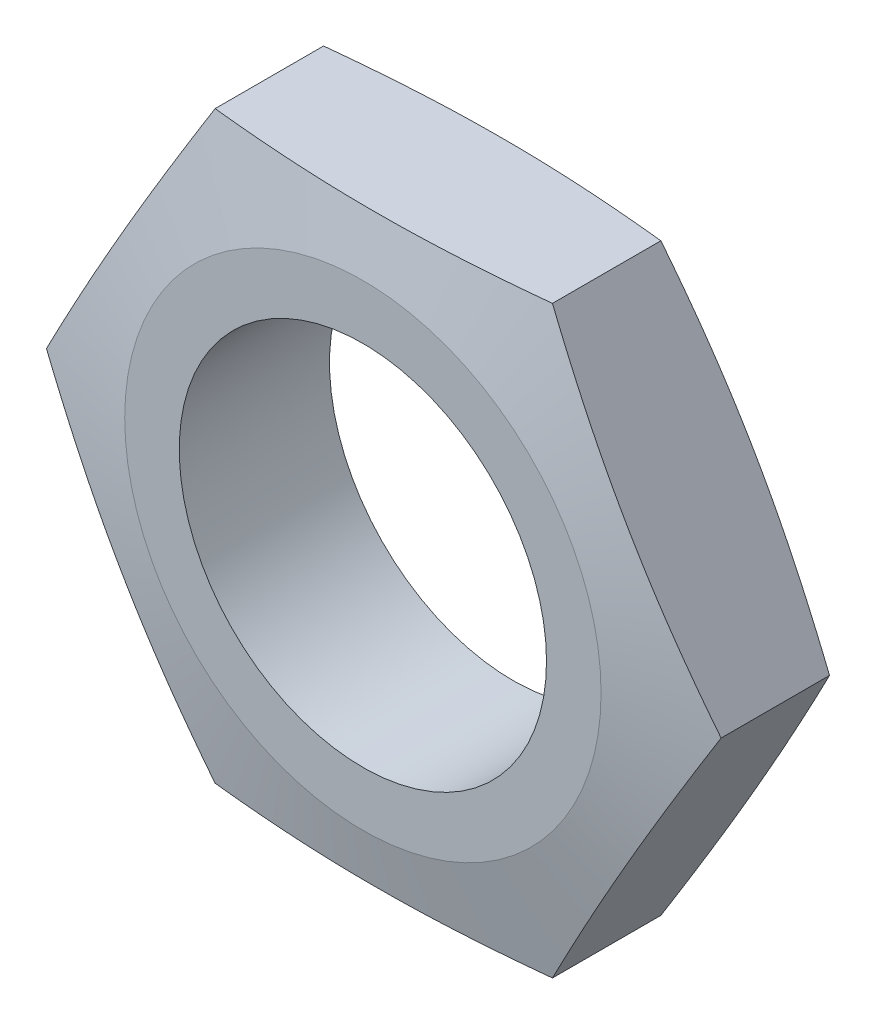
ISO-10303-21;
HEADER;
FILE_DESCRIPTION(('STEP AP214'),'2;1');
FILE_NAME('part.step','',(''),(''),'','','');
FILE_SCHEMA(('AUTOMOTIVE_DESIGN { 1 0 10303 214 1 1 1 1 }'));
ENDSEC;
DATA;
#1=APPLICATION_CONTEXT('core data for automotive mechanical design processes');
#2=APPLICATION_PROTOCOL_DEFINITION('international standard','automotive_design',2000,#1);
#3=PRODUCT_CONTEXT('',#1,'mechanical');
#4=PRODUCT('Part','Part','',(#3));
#5=PRODUCT_RELATED_PRODUCT_CATEGORY('part','',(#4));
#6=PRODUCT_DEFINITION_FORMATION('','',#4);
#7=PRODUCT_DEFINITION_CONTEXT('part definition',#1,'design');
#8=PRODUCT_DEFINITION('design','',#6,#7);
#9=PRODUCT_DEFINITION_SHAPE('','',#8);
#10=(LENGTH_UNIT() NAMED_UNIT(*) SI_UNIT(.MILLI.,.METRE.));
#11=(NAMED_UNIT(*) PLANE_ANGLE_UNIT() SI_UNIT($,.RADIAN.));
#12=(NAMED_UNIT(*) SI_UNIT($,.STERADIAN.) SOLID_ANGLE_UNIT());
#13=UNCERTAINTY_MEASURE_WITH_UNIT(LENGTH_MEASURE(1.E-05),#10,'distance_accuracy_value','');
#14=(GEOMETRIC_REPRESENTATION_CONTEXT(3) GLOBAL_UNCERTAINTY_ASSIGNED_CONTEXT((#13)) GLOBAL_UNIT_ASSIGNED_CONTEXT((#10,
#11,#12)) REPRESENTATION_CONTEXT('',''));
#15=CARTESIAN_POINT('',(0.,0.,0.));
#16=DIRECTION('',(0.,0.,1.));
#17=DIRECTION('',(1.,0.,0.));
#18=AXIS2_PLACEMENT_3D('',#15,#16,#17);
#19=CARTESIAN_POINT('',(-5.13264389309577,-8.89,2.286));
#20=DIRECTION('',(0.,1.,0.));
#21=DIRECTION('',(-1.,0.,0.));
#22=AXIS2_PLACEMENT_3D('',#19,#20,#21);
#23=PLANE('',#22);
#24=CARTESIAN_POINT('',(-13.5389504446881,-8.89,0.398716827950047));
#25=CARTESIAN_POINT('',(-13.13577838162,-8.89,0.469772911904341));
#26=CARTESIAN_POINT('',(-12.7324462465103,-8.89,0.539936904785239));
#27=CARTESIAN_POINT('',(-11.9253845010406,-8.89,0.678005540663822));
#28=CARTESIAN_POINT('',(-11.5216548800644,-8.89,0.74591012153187));
#29=CARTESIAN_POINT('',(-10.7134952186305,-8.89,0.879021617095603));
#30=CARTESIAN_POINT('',(-10.309064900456,-8.89,0.944226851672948));
#31=CARTESIAN_POINT('',(-9.49967433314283,-8.89,1.07125883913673));
#32=CARTESIAN_POINT('',(-9.09471408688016,-8.89,1.13308561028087));
#33=CARTESIAN_POINT('',(-8.2861498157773,-8.89,1.25228035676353));
#34=CARTESIAN_POINT('',(-7.8825487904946,-8.89,1.30966858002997));
#35=CARTESIAN_POINT('',(-7.07465636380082,-8.89,1.4193512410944));
#36=CARTESIAN_POINT('',(-6.67036497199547,-8.89,1.47164574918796));
#37=CARTESIAN_POINT('',(-5.86104887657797,-8.89,1.56997388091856));
#38=CARTESIAN_POINT('',(-5.45602423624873,-8.89,1.6160080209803));
#39=CARTESIAN_POINT('',(-4.64517476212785,-8.89,1.70047798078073));
#40=CARTESIAN_POINT('',(-4.23934992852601,-8.89,1.73891380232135));
#41=CARTESIAN_POINT('',(-3.42416088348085,-8.89,1.80698098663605));
#42=CARTESIAN_POINT('',(-3.01479142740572,-8.89,1.83655043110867));
#43=CARTESIAN_POINT('',(-2.19542155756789,-8.89,1.88514118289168));
#44=CARTESIAN_POINT('',(-1.78542115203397,-8.89,1.90416262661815));
#45=CARTESIAN_POINT('',(-0.965148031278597,-8.89,1.9306064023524));
#46=CARTESIAN_POINT('',(-0.554875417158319,-8.89,1.93803181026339));
#47=CARTESIAN_POINT('',(0.265711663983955,-8.89,1.94084566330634));
#48=CARTESIAN_POINT('',(0.676026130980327,-8.89,1.93623411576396));
#49=CARTESIAN_POINT('',(1.49727621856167,-8.89,1.91523087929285));
#50=CARTESIAN_POINT('',(1.90821114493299,-8.89,1.89881256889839));
#51=CARTESIAN_POINT('',(2.72949672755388,-8.89,1.85509983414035));
#52=CARTESIAN_POINT('',(3.13984737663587,-8.89,1.82780527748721));
#53=CARTESIAN_POINT('',(3.95994678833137,-8.89,1.76367016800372));
#54=CARTESIAN_POINT('',(4.36969526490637,-8.89,1.72682601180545));
#55=CARTESIAN_POINT('',(5.18837857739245,-8.89,1.64507569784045));
#56=CARTESIAN_POINT('',(5.59731341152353,-8.89,1.60016952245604));
#57=CARTESIAN_POINT('',(6.39205589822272,-8.89,1.50634278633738));
#58=CARTESIAN_POINT('',(6.77790571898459,-8.89,1.45777589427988));
#59=CARTESIAN_POINT('',(7.54896076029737,-8.89,1.35574653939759));
#60=CARTESIAN_POINT('',(7.93416596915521,-8.89,1.3022839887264));
#61=CARTESIAN_POINT('',(8.70401923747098,-8.89,1.19134899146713));
#62=CARTESIAN_POINT('',(9.0886672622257,-8.89,1.13387630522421));
#63=CARTESIAN_POINT('',(9.85745933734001,-8.89,1.0156457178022));
#64=CARTESIAN_POINT('',(10.2416033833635,-8.89,0.954887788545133));
#65=CARTESIAN_POINT('',(11.3935270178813,-8.89,0.768578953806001));
#66=CARTESIAN_POINT('',(12.1606566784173,-8.88999999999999,0.639013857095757));
#67=CARTESIAN_POINT('',(13.6936094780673,-8.88999999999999,0.372617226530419));
#68=CARTESIAN_POINT('',(14.4594326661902,-8.88999999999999,0.235785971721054));
#69=CARTESIAN_POINT('',(15.9854281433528,-8.88999999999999,-0.0421323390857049));
#70=CARTESIAN_POINT('',(16.7456061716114,-8.88999999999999,-0.183187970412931));
#71=CARTESIAN_POINT('',(18.2652832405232,-8.88999999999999,-0.468948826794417));
#72=CARTESIAN_POINT('',(19.024782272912,-8.88999999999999,-0.613654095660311));
#73=CARTESIAN_POINT('',(20.5426135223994,-8.88999999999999,-0.905631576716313));
#74=CARTESIAN_POINT('',(21.3009461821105,-8.88999999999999,-1.05290149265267));
#75=CARTESIAN_POINT('',(22.8171895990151,-8.88999999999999,-1.34951165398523));
#76=CARTESIAN_POINT('',(23.5751003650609,-8.88999999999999,-1.49885185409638));
#77=CARTESIAN_POINT('',(24.3328647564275,-8.88999999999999,-1.64892209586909));
#78=B_SPLINE_CURVE_WITH_KNOTS('',3,(#24,#25,#26,#27,#28,#29,#30,#31,#32,#33,#34,#35,#36,#37,#38,
#39,#40,#41,#42,#43,#44,#45,#46,#47,#48,#49,#50,#51,#52,#53,#54,#55,#56,#57,#58,#59,#60,#61,#62,
#63,#64,#65,#66,#67,#68,#69,#70,#71,#72,#73,#74,#75,#76,#77),.UNSPECIFIED.,.F.,.F.,(4,2,2,2,2,2,
2,2,2,2,2,2,2,2,2,2,2,2,2,2,2,2,2,2,2,2,4),(0.,1.22816040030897,2.45635454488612,
3.68530198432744,4.91424278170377,6.13719865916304,7.36013765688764,8.58297571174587,
9.80581347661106,11.0370020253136,12.2681746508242,13.4990206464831,14.7298658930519,
15.9634951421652,17.1971393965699,18.431249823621,19.6653629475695,20.8320090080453,
21.9986760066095,23.1654127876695,24.332159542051,26.6660818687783,28.9999146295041,
31.3193643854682,33.6388419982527,35.9563399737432,38.2737873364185),.UNSPECIFIED.);
#79=CARTESIAN_POINT('',(-5.13264389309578,-8.89,1.64964364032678));
#80=VERTEX_POINT('',#79);
#81=CARTESIAN_POINT('',(5.13264389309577,-8.89,1.64964364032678));
#82=VERTEX_POINT('',#81);
#83=EDGE_CURVE('E208',#80,#82,#78,.T.);
#84=ORIENTED_EDGE('',*,*,#83,.F.);
#85=DIRECTION('',(0.,0.,-1.));
#86=VECTOR('',#85,1.);
#87=CARTESIAN_POINT('',(-5.13264389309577,-8.89,2.286));
#88=LINE('',#87,#86);
#89=CARTESIAN_POINT('',(-5.13264389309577,-8.89,-1.64964364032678));
#90=VERTEX_POINT('',#89);
#91=EDGE_CURVE('E64',#80,#90,#88,.T.);
#92=ORIENTED_EDGE('',*,*,#91,.T.);
#93=CARTESIAN_POINT('',(-13.5389504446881,-8.89,-0.398716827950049));
#94=CARTESIAN_POINT('',(-13.13577838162,-8.89,-0.469772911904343));
#95=CARTESIAN_POINT('',(-12.7324462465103,-8.89,-0.539936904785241));
#96=CARTESIAN_POINT('',(-11.9253845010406,-8.89,-0.678005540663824));
#97=CARTESIAN_POINT('',(-11.5216548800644,-8.89,-0.745910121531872));
#98=CARTESIAN_POINT('',(-10.7134952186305,-8.89,-0.879021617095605));
#99=CARTESIAN_POINT('',(-10.309064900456,-8.89,-0.94422685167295));
#100=CARTESIAN_POINT('',(-9.49967433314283,-8.89,-1.07125883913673));
#101=CARTESIAN_POINT('',(-9.09471408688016,-8.89,-1.13308561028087));
#102=CARTESIAN_POINT('',(-8.2861498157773,-8.89,-1.25228035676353));
#103=CARTESIAN_POINT('',(-7.8825487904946,-8.89,-1.30966858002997));
#104=CARTESIAN_POINT('',(-7.07465636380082,-8.89,-1.4193512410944));
#105=CARTESIAN_POINT('',(-6.67036497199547,-8.89,-1.47164574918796));
#106=CARTESIAN_POINT('',(-5.86104887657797,-8.89,-1.56997388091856));
#107=CARTESIAN_POINT('',(-5.45602423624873,-8.89,-1.6160080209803));
#108=CARTESIAN_POINT('',(-4.64517476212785,-8.89,-1.70047798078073));
#109=CARTESIAN_POINT('',(-4.23934992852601,-8.89,-1.73891380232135));
#110=CARTESIAN_POINT('',(-3.42416088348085,-8.89,-1.80698098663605));
#111=CARTESIAN_POINT('',(-3.01479142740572,-8.89,-1.83655043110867));
#112=CARTESIAN_POINT('',(-2.19542155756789,-8.89,-1.88514118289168));
#113=CARTESIAN_POINT('',(-1.78542115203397,-8.89,-1.90416262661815));
#114=CARTESIAN_POINT('',(-0.965148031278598,-8.89,-1.9306064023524));
#115=CARTESIAN_POINT('',(-0.554875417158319,-8.89,-1.93803181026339));
#116=CARTESIAN_POINT('',(0.265711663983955,-8.89,-1.94084566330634));
#117=CARTESIAN_POINT('',(0.676026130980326,-8.89,-1.93623411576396));
#118=CARTESIAN_POINT('',(1.49727621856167,-8.89,-1.91523087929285));
#119=CARTESIAN_POINT('',(1.90821114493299,-8.89,-1.89881256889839));
#120=CARTESIAN_POINT('',(2.72949672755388,-8.89,-1.85509983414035));
#121=CARTESIAN_POINT('',(3.13984737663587,-8.89,-1.82780527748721));
#122=CARTESIAN_POINT('',(3.95994678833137,-8.89,-1.76367016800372));
#123=CARTESIAN_POINT('',(4.36969526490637,-8.89,-1.72682601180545));
#124=CARTESIAN_POINT('',(5.18837857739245,-8.89,-1.64507569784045));
#125=CARTESIAN_POINT('',(5.59731341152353,-8.89,-1.60016952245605));
#126=CARTESIAN_POINT('',(6.39205589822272,-8.89,-1.50634278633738));
#127=CARTESIAN_POINT('',(6.77790571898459,-8.89,-1.45777589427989));
#128=CARTESIAN_POINT('',(7.54896076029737,-8.89,-1.35574653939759));
#129=CARTESIAN_POINT('',(7.9341659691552,-8.89,-1.3022839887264));
#130=CARTESIAN_POINT('',(8.70401923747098,-8.89,-1.19134899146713));
#131=CARTESIAN_POINT('',(9.0886672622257,-8.89,-1.13387630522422));
#132=CARTESIAN_POINT('',(9.85745933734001,-8.89,-1.0156457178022));
#133=CARTESIAN_POINT('',(10.2416033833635,-8.89,-0.954887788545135));
#134=CARTESIAN_POINT('',(11.3935270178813,-8.89,-0.768578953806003));
#135=CARTESIAN_POINT('',(12.1606566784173,-8.88999999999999,-0.639013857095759));
#136=CARTESIAN_POINT('',(13.6936094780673,-8.88999999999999,-0.372617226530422));
#137=CARTESIAN_POINT('',(14.4594326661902,-8.88999999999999,-0.235785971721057));
#138=CARTESIAN_POINT('',(15.9854281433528,-8.88999999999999,0.0421323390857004));
#139=CARTESIAN_POINT('',(16.7456061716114,-8.88999999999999,0.183187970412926));
#140=CARTESIAN_POINT('',(18.2652832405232,-8.88999999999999,0.468948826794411));
#141=CARTESIAN_POINT('',(19.024782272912,-8.88999999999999,0.613654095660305));
#142=CARTESIAN_POINT('',(20.5426135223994,-8.88999999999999,0.905631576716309));
#143=CARTESIAN_POINT('',(21.3009461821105,-8.88999999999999,1.05290149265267));
#144=CARTESIAN_POINT('',(22.8171895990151,-8.88999999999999,1.34951165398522));
#145=CARTESIAN_POINT('',(23.5751003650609,-8.88999999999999,1.49885185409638));
#146=CARTESIAN_POINT('',(24.3328647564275,-8.88999999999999,1.64892209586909));
#147=B_SPLINE_CURVE_WITH_KNOTS('',3,(#93,#94,#95,#96,#97,#98,#99,#100,#101,#102,#103,#104,#105,
#106,#107,#108,#109,#110,#111,#112,#113,#114,#115,#116,#117,#118,#119,#120,#121,#122,#123,#124,
#125,#126,#127,#128,#129,#130,#131,#132,#133,#134,#135,#136,#137,#138,#139,#140,#141,#142,#143,
#144,#145,#146),.UNSPECIFIED.,.F.,.F.,(4,2,2,2,2,2,2,2,2,2,2,2,2,2,2,2,2,2,2,2,2,2,2,2,2,2,4),
(0.,1.22816040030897,2.45635454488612,3.68530198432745,4.91424278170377,6.13719865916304,
7.36013765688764,8.58297571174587,9.80581347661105,11.0370020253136,12.2681746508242,
13.4990206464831,14.7298658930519,15.9634951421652,17.1971393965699,18.431249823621,
19.6653629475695,20.8320090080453,21.9986760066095,23.1654127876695,24.332159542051,
26.6660818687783,28.9999146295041,31.3193643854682,33.6388419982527,35.9563399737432,
38.2737873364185),.UNSPECIFIED.);
#148=CARTESIAN_POINT('',(5.13264389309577,-8.89,-1.64964364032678));
#149=VERTEX_POINT('',#148);
#150=EDGE_CURVE('E134',#149,#90,#147,.F.);
#151=ORIENTED_EDGE('',*,*,#150,.F.);
#152=DIRECTION('',(0.,0.,-1.));
#153=VECTOR('',#152,1.);
#154=CARTESIAN_POINT('',(5.13264389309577,-8.89,2.286));
#155=LINE('',#154,#153);
#156=EDGE_CURVE('E49',#82,#149,#155,.T.);
#157=ORIENTED_EDGE('',*,*,#156,.F.);
#158=EDGE_LOOP('',(#84,#92,#151,#157));
#159=FACE_BOUND('',#158,.T.);
#160=ADVANCED_FACE('F35',(#159),#23,.F.);
#161=CARTESIAN_POINT('',(5.13264389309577,-8.89,2.286));
#162=DIRECTION('',(-0.866025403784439,0.5,0.));
#163=DIRECTION('',(-0.5,-0.866025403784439,0.));
#164=AXIS2_PLACEMENT_3D('',#161,#162,#163);
#165=PLANE('',#164);
#166=CARTESIAN_POINT('',(5.13252842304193,-8.8902,1.64961928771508));
#167=CARTESIAN_POINT('',(5.34595380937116,-8.52053638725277,1.69464932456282));
#168=CARTESIAN_POINT('',(5.55962047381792,-8.15045486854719,1.73549140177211));
#169=CARTESIAN_POINT('',(5.98742170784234,-7.40948139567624,1.80720215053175));
#170=CARTESIAN_POINT('',(6.20155637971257,-7.03858926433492,1.83806836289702));
#171=CARTESIAN_POINT('',(6.62948643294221,-6.29739267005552,1.88812572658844));
#172=CARTESIAN_POINT('',(6.84328069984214,-5.92709013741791,1.90735400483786));
#173=CARTESIAN_POINT('',(7.27103860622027,-5.1861917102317,1.93313373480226));
#174=CARTESIAN_POINT('',(7.48500222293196,-4.81559585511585,1.93968667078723));
#175=CARTESIAN_POINT('',(7.91292945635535,-4.07440414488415,1.93968667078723));
#176=CARTESIAN_POINT('',(8.12689307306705,-3.7038082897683,1.93313373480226));
#177=CARTESIAN_POINT('',(8.55465097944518,-2.96290986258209,1.90735400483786));
#178=CARTESIAN_POINT('',(8.76844524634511,-2.59260732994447,1.88812572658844));
#179=CARTESIAN_POINT('',(9.19637529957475,-1.85141073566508,1.83806836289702));
#180=CARTESIAN_POINT('',(9.41050997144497,-1.48051860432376,1.80720215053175));
#181=CARTESIAN_POINT('',(9.83831120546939,-0.7395451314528,1.73549140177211));
#182=CARTESIAN_POINT('',(10.0519778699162,-0.369463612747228,1.69464932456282));
#183=CARTESIAN_POINT('',(10.2654032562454,0.000199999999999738,1.64961928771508));
#184=B_SPLINE_CURVE_WITH_KNOTS('',3,(#166,#167,#168,#169,#170,#171,#172,#173,#174,#175,#176,
#177,#178,#179,#180,#181,#182,#183),.UNSPECIFIED.,.F.,.F.,(4,2,2,2,2,2,2,2,4),(0.,
1.28769865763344,2.57571450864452,3.85959941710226,5.14333397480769,6.42706853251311,
7.71095344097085,8.99896929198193,10.2866679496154),.UNSPECIFIED.);
#185=CARTESIAN_POINT('',(10.2652877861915,0.,1.64964364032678));
#186=VERTEX_POINT('',#185);
#187=EDGE_CURVE('E130',#82,#186,#184,.T.);
#188=ORIENTED_EDGE('',*,*,#187,.F.);
#189=ORIENTED_EDGE('',*,*,#156,.T.);
#190=CARTESIAN_POINT('',(10.2654032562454,0.000200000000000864,-1.64961928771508));
#191=CARTESIAN_POINT('',(10.0519778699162,-0.369463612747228,-1.69464932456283));
#192=CARTESIAN_POINT('',(9.83831120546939,-0.7395451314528,-1.73549140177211));
#193=CARTESIAN_POINT('',(9.41050997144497,-1.48051860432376,-1.80720215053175));
#194=CARTESIAN_POINT('',(9.19637529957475,-1.85141073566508,-1.83806836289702));
#195=CARTESIAN_POINT('',(8.7684452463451,-2.59260732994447,-1.88812572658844));
#196=CARTESIAN_POINT('',(8.55465097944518,-2.96290986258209,-1.90735400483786));
#197=CARTESIAN_POINT('',(8.12689307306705,-3.7038082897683,-1.93313373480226));
#198=CARTESIAN_POINT('',(7.91292945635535,-4.07440414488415,-1.93968667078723));
#199=CARTESIAN_POINT('',(7.48500222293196,-4.81559585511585,-1.93968667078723));
#200=CARTESIAN_POINT('',(7.27103860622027,-5.1861917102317,-1.93313373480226));
#201=CARTESIAN_POINT('',(6.84328069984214,-5.92709013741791,-1.90735400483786));
#202=CARTESIAN_POINT('',(6.62948643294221,-6.29739267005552,-1.88812572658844));
#203=CARTESIAN_POINT('',(6.20155637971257,-7.03858926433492,-1.83806836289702));
#204=CARTESIAN_POINT('',(5.98742170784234,-7.40948139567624,-1.80720215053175));
#205=CARTESIAN_POINT('',(5.55962047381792,-8.1504548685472,-1.73549140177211));
#206=CARTESIAN_POINT('',(5.34595380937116,-8.52053638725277,-1.69464932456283));
#207=CARTESIAN_POINT('',(5.13252842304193,-8.8902,-1.64961928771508));
#208=B_SPLINE_CURVE_WITH_KNOTS('',3,(#190,#191,#192,#193,#194,#195,#196,#197,#198,#199,#200,
#201,#202,#203,#204,#205,#206,#207),.UNSPECIFIED.,.F.,.F.,(4,2,2,2,2,2,2,2,4),(0.,
1.28769865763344,2.57571450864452,3.85959941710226,5.14333397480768,6.42706853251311,
7.71095344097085,8.99896929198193,10.2866679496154),.UNSPECIFIED.);
#209=CARTESIAN_POINT('',(10.2652877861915,0.,-1.64964364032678));
#210=VERTEX_POINT('',#209);
#211=EDGE_CURVE('E129',#210,#149,#208,.T.);
#212=ORIENTED_EDGE('',*,*,#211,.F.);
#213=DIRECTION('',(0.,0.,-1.));
#214=VECTOR('',#213,1.);
#215=CARTESIAN_POINT('',(10.2652877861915,0.,2.286));
#216=LINE('',#215,#214);
#217=EDGE_CURVE('E117',#186,#210,#216,.T.);
#218=ORIENTED_EDGE('',*,*,#217,.F.);
#219=EDGE_LOOP('',(#188,#189,#212,#218));
#220=FACE_BOUND('',#219,.T.);
#221=ADVANCED_FACE('F127',(#220),#165,.F.);
#222=CARTESIAN_POINT('',(10.2652877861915,0.,2.286));
#223=DIRECTION('',(-0.866025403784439,-0.5,0.));
#224=DIRECTION('',(0.5,-0.866025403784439,0.));
#225=AXIS2_PLACEMENT_3D('',#222,#223,#224);
#226=PLANE('',#225);
#227=CARTESIAN_POINT('',(10.2654032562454,-0.000199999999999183,1.64961928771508));
#228=CARTESIAN_POINT('',(10.0519778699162,0.369463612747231,1.69464932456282));
#229=CARTESIAN_POINT('',(9.83831120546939,0.739545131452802,1.73549140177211));
#230=CARTESIAN_POINT('',(9.41050997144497,1.48051860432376,1.80720215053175));
#231=CARTESIAN_POINT('',(9.19637529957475,1.85141073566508,1.83806836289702));
#232=CARTESIAN_POINT('',(8.7684452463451,2.59260732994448,1.88812572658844));
#233=CARTESIAN_POINT('',(8.55465097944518,2.96290986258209,1.90735400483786));
#234=CARTESIAN_POINT('',(8.12689307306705,3.7038082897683,1.93313373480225));
#235=CARTESIAN_POINT('',(7.91292945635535,4.07440414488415,1.93968667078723));
#236=CARTESIAN_POINT('',(7.48500222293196,4.81559585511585,1.93968667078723));
#237=CARTESIAN_POINT('',(7.27103860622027,5.1861917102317,1.93313373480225));
#238=CARTESIAN_POINT('',(6.84328069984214,5.92709013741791,1.90735400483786));
#239=CARTESIAN_POINT('',(6.62948643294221,6.29739267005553,1.88812572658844));
#240=CARTESIAN_POINT('',(6.20155637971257,7.03858926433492,1.83806836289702));
#241=CARTESIAN_POINT('',(5.98742170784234,7.40948139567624,1.80720215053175));
#242=CARTESIAN_POINT('',(5.55962047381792,8.1504548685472,1.73549140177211));
#243=CARTESIAN_POINT('',(5.34595380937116,8.52053638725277,1.69464932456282));
#244=CARTESIAN_POINT('',(5.13252842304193,8.8902,1.64961928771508));
#245=B_SPLINE_CURVE_WITH_KNOTS('',3,(#227,#228,#229,#230,#231,#232,#233,#234,#235,#236,#237,
#238,#239,#240,#241,#242,#243,#244),.UNSPECIFIED.,.F.,.F.,(4,2,2,2,2,2,2,2,4),(0.,
1.28769865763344,2.57571450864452,3.85959941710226,5.14333397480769,6.42706853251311,
7.71095344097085,8.99896929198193,10.2866679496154),.UNSPECIFIED.);
#246=CARTESIAN_POINT('',(5.13264389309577,8.89,1.64964364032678));
#247=VERTEX_POINT('',#246);
#248=EDGE_CURVE('E97',#186,#247,#245,.T.);
#249=ORIENTED_EDGE('',*,*,#248,.F.);
#250=ORIENTED_EDGE('',*,*,#217,.T.);
#251=CARTESIAN_POINT('',(5.13252842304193,8.8902,-1.64961928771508));
#252=CARTESIAN_POINT('',(5.34595380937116,8.52053638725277,-1.69464932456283));
#253=CARTESIAN_POINT('',(5.55962047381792,8.1504548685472,-1.73549140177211));
#254=CARTESIAN_POINT('',(5.98742170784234,7.40948139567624,-1.80720215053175));
#255=CARTESIAN_POINT('',(6.20155637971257,7.03858926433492,-1.83806836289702));
#256=CARTESIAN_POINT('',(6.62948643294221,6.29739267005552,-1.88812572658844));
#257=CARTESIAN_POINT('',(6.84328069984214,5.92709013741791,-1.90735400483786));
#258=CARTESIAN_POINT('',(7.27103860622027,5.1861917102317,-1.93313373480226));
#259=CARTESIAN_POINT('',(7.48500222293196,4.81559585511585,-1.93968667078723));
#260=CARTESIAN_POINT('',(7.91292945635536,4.07440414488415,-1.93968667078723));
#261=CARTESIAN_POINT('',(8.12689307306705,3.7038082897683,-1.93313373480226));
#262=CARTESIAN_POINT('',(8.55465097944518,2.96290986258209,-1.90735400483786));
#263=CARTESIAN_POINT('',(8.76844524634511,2.59260732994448,-1.88812572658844));
#264=CARTESIAN_POINT('',(9.19637529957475,1.85141073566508,-1.83806836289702));
#265=CARTESIAN_POINT('',(9.41050997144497,1.48051860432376,-1.80720215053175));
#266=CARTESIAN_POINT('',(9.83831120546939,0.739545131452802,-1.73549140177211));
#267=CARTESIAN_POINT('',(10.0519778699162,0.369463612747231,-1.69464932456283));
#268=CARTESIAN_POINT('',(10.2654032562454,-0.000199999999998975,-1.64961928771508));
#269=B_SPLINE_CURVE_WITH_KNOTS('',3,(#251,#252,#253,#254,#255,#256,#257,#258,#259,#260,#261,
#262,#263,#264,#265,#266,#267,#268),.UNSPECIFIED.,.F.,.F.,(4,2,2,2,2,2,2,2,4),(0.,
1.28769865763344,2.57571450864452,3.85959941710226,5.14333397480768,6.42706853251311,
7.71095344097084,8.99896929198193,10.2866679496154),.UNSPECIFIED.);
#270=CARTESIAN_POINT('',(5.13264389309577,8.89,-1.64964364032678));
#271=VERTEX_POINT('',#270);
#272=EDGE_CURVE('E137',#271,#210,#269,.T.);
#273=ORIENTED_EDGE('',*,*,#272,.F.);
#274=DIRECTION('',(0.,0.,-1.));
#275=VECTOR('',#274,1.);
#276=CARTESIAN_POINT('',(5.13264389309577,8.89,2.286));
#277=LINE('',#276,#275);
#278=EDGE_CURVE('E115',#247,#271,#277,.T.);
#279=ORIENTED_EDGE('',*,*,#278,.F.);
#280=EDGE_LOOP('',(#249,#250,#273,#279));
#281=FACE_BOUND('',#280,.T.);
#282=ADVANCED_FACE('F186',(#281),#226,.F.);
#283=CARTESIAN_POINT('',(5.13264389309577,8.89,2.286));
#284=DIRECTION('',(0.,-1.,0.));
#285=DIRECTION('',(0.,0.,-1.));
#286=AXIS2_PLACEMENT_3D('',#283,#284,#285);
#287=PLANE('',#286);
#288=CARTESIAN_POINT('',(-13.5389504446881,8.89,0.398716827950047));
#289=CARTESIAN_POINT('',(-13.13577838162,8.89,0.469772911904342));
#290=CARTESIAN_POINT('',(-12.7324462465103,8.89,0.53993690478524));
#291=CARTESIAN_POINT('',(-11.9253845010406,8.89,0.678005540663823));
#292=CARTESIAN_POINT('',(-11.5216548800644,8.89,0.74591012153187));
#293=CARTESIAN_POINT('',(-10.7134952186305,8.89,0.879021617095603));
#294=CARTESIAN_POINT('',(-10.309064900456,8.89,0.944226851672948));
#295=CARTESIAN_POINT('',(-9.49967433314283,8.89,1.07125883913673));
#296=CARTESIAN_POINT('',(-9.09471408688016,8.89,1.13308561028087));
#297=CARTESIAN_POINT('',(-8.28614981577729,8.89,1.25228035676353));
#298=CARTESIAN_POINT('',(-7.8825487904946,8.89,1.30966858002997));
#299=CARTESIAN_POINT('',(-7.07465636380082,8.89,1.4193512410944));
#300=CARTESIAN_POINT('',(-6.67036497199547,8.89,1.47164574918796));
#301=CARTESIAN_POINT('',(-5.86104887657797,8.89,1.56997388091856));
#302=CARTESIAN_POINT('',(-5.45602423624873,8.89,1.6160080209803));
#303=CARTESIAN_POINT('',(-4.64517476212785,8.89,1.70047798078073));
#304=CARTESIAN_POINT('',(-4.23934992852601,8.89,1.73891380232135));
#305=CARTESIAN_POINT('',(-3.42416088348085,8.89,1.80698098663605));
#306=CARTESIAN_POINT('',(-3.01479142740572,8.89,1.83655043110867));
#307=CARTESIAN_POINT('',(-2.19542155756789,8.89,1.88514118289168));
#308=CARTESIAN_POINT('',(-1.78542115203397,8.89,1.90416262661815));
#309=CARTESIAN_POINT('',(-0.965148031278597,8.89,1.9306064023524));
#310=CARTESIAN_POINT('',(-0.554875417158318,8.89,1.93803181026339));
#311=CARTESIAN_POINT('',(0.265711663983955,8.89,1.94084566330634));
#312=CARTESIAN_POINT('',(0.676026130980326,8.89,1.93623411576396));
#313=CARTESIAN_POINT('',(1.49727621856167,8.89,1.91523087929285));
#314=CARTESIAN_POINT('',(1.90821114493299,8.89,1.89881256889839));
#315=CARTESIAN_POINT('',(2.72949672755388,8.89,1.85509983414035));
#316=CARTESIAN_POINT('',(3.13984737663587,8.89,1.82780527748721));
#317=CARTESIAN_POINT('',(3.95994678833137,8.89,1.76367016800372));
#318=CARTESIAN_POINT('',(4.36969526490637,8.89,1.72682601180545));
#319=CARTESIAN_POINT('',(5.18837857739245,8.89,1.64507569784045));
#320=CARTESIAN_POINT('',(5.59731341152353,8.89,1.60016952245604));
#321=CARTESIAN_POINT('',(6.39205589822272,8.89,1.50634278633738));
#322=CARTESIAN_POINT('',(6.77790571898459,8.89,1.45777589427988));
#323=CARTESIAN_POINT('',(7.54896076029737,8.89,1.35574653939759));
#324=CARTESIAN_POINT('',(7.93416596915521,8.89,1.3022839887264));
#325=CARTESIAN_POINT('',(8.70401923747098,8.89,1.19134899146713));
#326=CARTESIAN_POINT('',(9.0886672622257,8.89,1.13387630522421));
#327=CARTESIAN_POINT('',(9.85745933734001,8.89,1.0156457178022));
#328=CARTESIAN_POINT('',(10.2416033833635,8.89,0.954887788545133));
#329=CARTESIAN_POINT('',(11.3935270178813,8.89,0.768578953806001));
#330=CARTESIAN_POINT('',(12.1606566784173,8.89,0.639013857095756));
#331=CARTESIAN_POINT('',(13.6936094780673,8.89,0.372617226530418));
#332=CARTESIAN_POINT('',(14.4594326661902,8.89,0.235785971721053));
#333=CARTESIAN_POINT('',(15.9854281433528,8.89,-0.0421323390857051));
#334=CARTESIAN_POINT('',(16.7456061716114,8.89,-0.183187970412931));
#335=CARTESIAN_POINT('',(18.2652832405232,8.89,-0.468948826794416));
#336=CARTESIAN_POINT('',(19.024782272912,8.89,-0.61365409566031));
#337=CARTESIAN_POINT('',(20.5426135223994,8.89,-0.905631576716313));
#338=CARTESIAN_POINT('',(21.3009461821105,8.89,-1.05290149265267));
#339=CARTESIAN_POINT('',(22.8171895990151,8.89,-1.34951165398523));
#340=CARTESIAN_POINT('',(23.5751003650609,8.89,-1.49885185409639));
#341=CARTESIAN_POINT('',(24.3328647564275,8.89,-1.64892209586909));
#342=B_SPLINE_CURVE_WITH_KNOTS('',3,(#288,#289,#290,#291,#292,#293,#294,#295,#296,#297,#298,
#299,#300,#301,#302,#303,#304,#305,#306,#307,#308,#309,#310,#311,#312,#313,#314,#315,#316,#317,
#318,#319,#320,#321,#322,#323,#324,#325,#326,#327,#328,#329,#330,#331,#332,#333,#334,#335,#336,
#337,#338,#339,#340,#341),.UNSPECIFIED.,.F.,.F.,(4,2,2,2,2,2,2,2,2,2,2,2,2,2,2,2,2,2,2,2,2,2,2,
2,2,2,4),(0.,1.22816040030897,2.45635454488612,3.68530198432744,4.91424278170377,
6.13719865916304,7.36013765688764,8.58297571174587,9.80581347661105,11.0370020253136,
12.2681746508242,13.4990206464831,14.7298658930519,15.9634951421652,17.1971393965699,
18.431249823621,19.6653629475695,20.8320090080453,21.9986760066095,23.1654127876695,
24.332159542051,26.6660818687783,28.9999146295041,31.3193643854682,33.6388419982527,
35.9563399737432,38.2737873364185),.UNSPECIFIED.);
#343=CARTESIAN_POINT('',(-5.13264389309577,8.89,1.64964364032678));
#344=VERTEX_POINT('',#343);
#345=EDGE_CURVE('E94',#247,#344,#342,.F.);
#346=ORIENTED_EDGE('',*,*,#345,.F.);
#347=ORIENTED_EDGE('',*,*,#278,.T.);
#348=CARTESIAN_POINT('',(-13.5389504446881,8.89,-0.398716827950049));
#349=CARTESIAN_POINT('',(-13.13577838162,8.89,-0.469772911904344));
#350=CARTESIAN_POINT('',(-12.7324462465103,8.89,-0.539936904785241));
#351=CARTESIAN_POINT('',(-11.9253845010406,8.89,-0.678005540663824));
#352=CARTESIAN_POINT('',(-11.5216548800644,8.89,-0.745910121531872));
#353=CARTESIAN_POINT('',(-10.7134952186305,8.89,-0.879021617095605));
#354=CARTESIAN_POINT('',(-10.309064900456,8.89,-0.944226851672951));
#355=CARTESIAN_POINT('',(-9.49967433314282,8.89,-1.07125883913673));
#356=CARTESIAN_POINT('',(-9.09471408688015,8.89,-1.13308561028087));
#357=CARTESIAN_POINT('',(-8.28614981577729,8.89,-1.25228035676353));
#358=CARTESIAN_POINT('',(-7.8825487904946,8.89,-1.30966858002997));
#359=CARTESIAN_POINT('',(-7.07465636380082,8.89,-1.4193512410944));
#360=CARTESIAN_POINT('',(-6.67036497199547,8.89,-1.47164574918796));
#361=CARTESIAN_POINT('',(-5.86104887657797,8.89,-1.56997388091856));
#362=CARTESIAN_POINT('',(-5.45602423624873,8.89,-1.6160080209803));
#363=CARTESIAN_POINT('',(-4.64517476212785,8.89,-1.70047798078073));
#364=CARTESIAN_POINT('',(-4.23934992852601,8.89,-1.73891380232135));
#365=CARTESIAN_POINT('',(-3.42416088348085,8.89,-1.80698098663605));
#366=CARTESIAN_POINT('',(-3.01479142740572,8.89,-1.83655043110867));
#367=CARTESIAN_POINT('',(-2.19542155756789,8.89,-1.88514118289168));
#368=CARTESIAN_POINT('',(-1.78542115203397,8.89,-1.90416262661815));
#369=CARTESIAN_POINT('',(-0.965148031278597,8.89,-1.9306064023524));
#370=CARTESIAN_POINT('',(-0.554875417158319,8.89,-1.93803181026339));
#371=CARTESIAN_POINT('',(0.265711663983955,8.89,-1.94084566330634));
#372=CARTESIAN_POINT('',(0.676026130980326,8.89,-1.93623411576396));
#373=CARTESIAN_POINT('',(1.49727621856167,8.89,-1.91523087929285));
#374=CARTESIAN_POINT('',(1.90821114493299,8.89,-1.89881256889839));
#375=CARTESIAN_POINT('',(2.72949672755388,8.89,-1.85509983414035));
#376=CARTESIAN_POINT('',(3.13984737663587,8.89,-1.82780527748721));
#377=CARTESIAN_POINT('',(3.95994678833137,8.89,-1.76367016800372));
#378=CARTESIAN_POINT('',(4.36969526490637,8.89,-1.72682601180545));
#379=CARTESIAN_POINT('',(5.18837857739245,8.89,-1.64507569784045));
#380=CARTESIAN_POINT('',(5.59731341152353,8.89,-1.60016952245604));
#381=CARTESIAN_POINT('',(6.39205589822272,8.89,-1.50634278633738));
#382=CARTESIAN_POINT('',(6.77790571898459,8.89,-1.45777589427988));
#383=CARTESIAN_POINT('',(7.54896076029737,8.89,-1.35574653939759));
#384=CARTESIAN_POINT('',(7.9341659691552,8.89,-1.3022839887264));
#385=CARTESIAN_POINT('',(8.70401923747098,8.89,-1.19134899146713));
#386=CARTESIAN_POINT('',(9.0886672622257,8.89,-1.13387630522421));
#387=CARTESIAN_POINT('',(9.85745933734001,8.89,-1.0156457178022));
#388=CARTESIAN_POINT('',(10.2416033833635,8.89,-0.954887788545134));
#389=CARTESIAN_POINT('',(11.3935270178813,8.89,-0.768578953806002));
#390=CARTESIAN_POINT('',(12.1606566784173,8.89,-0.639013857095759));
#391=CARTESIAN_POINT('',(13.6936094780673,8.89,-0.372617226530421));
#392=CARTESIAN_POINT('',(14.4594326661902,8.89,-0.235785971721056));
#393=CARTESIAN_POINT('',(15.9854281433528,8.89,0.0421323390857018));
#394=CARTESIAN_POINT('',(16.7456061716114,8.89,0.183187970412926));
#395=CARTESIAN_POINT('',(18.2652832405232,8.89,0.468948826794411));
#396=CARTESIAN_POINT('',(19.024782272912,8.89,0.613654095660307));
#397=CARTESIAN_POINT('',(20.5426135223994,8.89,0.90563157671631));
#398=CARTESIAN_POINT('',(21.3009461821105,8.89,1.05290149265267));
#399=CARTESIAN_POINT('',(22.8171895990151,8.89,1.34951165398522));
#400=CARTESIAN_POINT('',(23.5751003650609,8.89,1.49885185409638));
#401=CARTESIAN_POINT('',(24.3328647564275,8.89,1.64892209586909));
#402=B_SPLINE_CURVE_WITH_KNOTS('',3,(#348,#349,#350,#351,#352,#353,#354,#355,#356,#357,#358,
#359,#360,#361,#362,#363,#364,#365,#366,#367,#368,#369,#370,#371,#372,#373,#374,#375,#376,#377,
#378,#379,#380,#381,#382,#383,#384,#385,#386,#387,#388,#389,#390,#391,#392,#393,#394,#395,#396,
#397,#398,#399,#400,#401),.UNSPECIFIED.,.F.,.F.,(4,2,2,2,2,2,2,2,2,2,2,2,2,2,2,2,2,2,2,2,2,2,2,
2,2,2,4),(0.,1.22816040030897,2.45635454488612,3.68530198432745,4.91424278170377,
6.13719865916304,7.36013765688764,8.58297571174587,9.80581347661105,11.0370020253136,
12.2681746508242,13.4990206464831,14.7298658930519,15.9634951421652,17.1971393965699,
18.431249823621,19.6653629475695,20.8320090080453,21.9986760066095,23.1654127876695,
24.332159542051,26.6660818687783,28.9999146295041,31.3193643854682,33.6388419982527,
35.9563399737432,38.2737873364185),.UNSPECIFIED.);
#403=CARTESIAN_POINT('',(-5.13264389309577,8.89,-1.64964364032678));
#404=VERTEX_POINT('',#403);
#405=EDGE_CURVE('E114',#404,#271,#402,.T.);
#406=ORIENTED_EDGE('',*,*,#405,.F.);
#407=DIRECTION('',(0.,0.,-1.));
#408=VECTOR('',#407,1.);
#409=CARTESIAN_POINT('',(-5.13264389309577,8.89,2.286));
#410=LINE('',#409,#408);
#411=EDGE_CURVE('E106',#344,#404,#410,.T.);
#412=ORIENTED_EDGE('',*,*,#411,.F.);
#413=EDGE_LOOP('',(#346,#347,#406,#412));
#414=FACE_BOUND('',#413,.T.);
#415=ADVANCED_FACE('F112',(#414),#287,.F.);
#416=CARTESIAN_POINT('',(-5.13264389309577,8.89,2.286));
#417=DIRECTION('',(0.866025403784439,-0.5,0.));
#418=DIRECTION('',(0.5,0.866025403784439,0.));
#419=AXIS2_PLACEMENT_3D('',#416,#417,#418);
#420=PLANE('',#419);
#421=CARTESIAN_POINT('',(-5.13252842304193,8.8902,1.64961928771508));
#422=CARTESIAN_POINT('',(-5.34595380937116,8.52053638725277,1.69464932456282));
#423=CARTESIAN_POINT('',(-5.55962047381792,8.1504548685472,1.73549140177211));
#424=CARTESIAN_POINT('',(-5.98742170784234,7.40948139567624,1.80720215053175));
#425=CARTESIAN_POINT('',(-6.20155637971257,7.03858926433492,1.83806836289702));
#426=CARTESIAN_POINT('',(-6.62948643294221,6.29739267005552,1.88812572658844));
#427=CARTESIAN_POINT('',(-6.84328069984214,5.92709013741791,1.90735400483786));
#428=CARTESIAN_POINT('',(-7.27103860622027,5.1861917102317,1.93313373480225));
#429=CARTESIAN_POINT('',(-7.48500222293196,4.81559585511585,1.93968667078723));
#430=CARTESIAN_POINT('',(-7.91292945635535,4.07440414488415,1.93968667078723));
#431=CARTESIAN_POINT('',(-8.12689307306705,3.7038082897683,1.93313373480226));
#432=CARTESIAN_POINT('',(-8.55465097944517,2.96290986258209,1.90735400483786));
#433=CARTESIAN_POINT('',(-8.7684452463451,2.59260732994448,1.88812572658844));
#434=CARTESIAN_POINT('',(-9.19637529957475,1.85141073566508,1.83806836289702));
#435=CARTESIAN_POINT('',(-9.41050997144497,1.48051860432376,1.80720215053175));
#436=CARTESIAN_POINT('',(-9.83831120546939,0.739545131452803,1.73549140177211));
#437=CARTESIAN_POINT('',(-10.0519778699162,0.369463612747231,1.69464932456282));
#438=CARTESIAN_POINT('',(-10.2654032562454,-0.000199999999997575,1.64961928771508));
#439=B_SPLINE_CURVE_WITH_KNOTS('',3,(#421,#422,#423,#424,#425,#426,#427,#428,#429,#430,#431,
#432,#433,#434,#435,#436,#437,#438),.UNSPECIFIED.,.F.,.F.,(4,2,2,2,2,2,2,2,4),(0.,
1.28769865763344,2.57571450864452,3.85959941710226,5.14333397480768,6.42706853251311,
7.71095344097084,8.99896929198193,10.2866679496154),.UNSPECIFIED.);
#440=CARTESIAN_POINT('',(-10.2652877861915,0.,1.64964364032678));
#441=VERTEX_POINT('',#440);
#442=EDGE_CURVE('E56',#344,#441,#439,.T.);
#443=ORIENTED_EDGE('',*,*,#442,.F.);
#444=ORIENTED_EDGE('',*,*,#411,.T.);
#445=CARTESIAN_POINT('',(-10.2654032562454,-0.000199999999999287,-1.64961928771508));
#446=CARTESIAN_POINT('',(-10.0519778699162,0.369463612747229,-1.69464932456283));
#447=CARTESIAN_POINT('',(-9.83831120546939,0.739545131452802,-1.73549140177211));
#448=CARTESIAN_POINT('',(-9.41050997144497,1.48051860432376,-1.80720215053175));
#449=CARTESIAN_POINT('',(-9.19637529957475,1.85141073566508,-1.83806836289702));
#450=CARTESIAN_POINT('',(-8.7684452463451,2.59260732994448,-1.88812572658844));
#451=CARTESIAN_POINT('',(-8.55465097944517,2.96290986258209,-1.90735400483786));
#452=CARTESIAN_POINT('',(-8.12689307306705,3.7038082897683,-1.93313373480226));
#453=CARTESIAN_POINT('',(-7.91292945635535,4.07440414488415,-1.93968667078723));
#454=CARTESIAN_POINT('',(-7.48500222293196,4.81559585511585,-1.93968667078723));
#455=CARTESIAN_POINT('',(-7.27103860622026,5.1861917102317,-1.93313373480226));
#456=CARTESIAN_POINT('',(-6.84328069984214,5.92709013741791,-1.90735400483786));
#457=CARTESIAN_POINT('',(-6.62948643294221,6.29739267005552,-1.88812572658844));
#458=CARTESIAN_POINT('',(-6.20155637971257,7.03858926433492,-1.83806836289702));
#459=CARTESIAN_POINT('',(-5.98742170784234,7.40948139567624,-1.80720215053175));
#460=CARTESIAN_POINT('',(-5.55962047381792,8.1504548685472,-1.73549140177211));
#461=CARTESIAN_POINT('',(-5.34595380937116,8.52053638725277,-1.69464932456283));
#462=CARTESIAN_POINT('',(-5.13252842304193,8.8902,-1.64961928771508));
#463=B_SPLINE_CURVE_WITH_KNOTS('',3,(#445,#446,#447,#448,#449,#450,#451,#452,#453,#454,#455,
#456,#457,#458,#459,#460,#461,#462),.UNSPECIFIED.,.F.,.F.,(4,2,2,2,2,2,2,2,4),(0.,
1.28769865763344,2.57571450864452,3.85959941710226,5.14333397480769,6.42706853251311,
7.71095344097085,8.99896929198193,10.2866679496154),.UNSPECIFIED.);
#464=CARTESIAN_POINT('',(-10.2652877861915,0.,-1.64964364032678));
#465=VERTEX_POINT('',#464);
#466=EDGE_CURVE('E167',#465,#404,#463,.T.);
#467=ORIENTED_EDGE('',*,*,#466,.F.);
#468=DIRECTION('',(0.,0.,-1.));
#469=VECTOR('',#468,1.);
#470=CARTESIAN_POINT('',(-10.2652877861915,0.,2.286));
#471=LINE('',#470,#469);
#472=EDGE_CURVE('E108',#441,#465,#471,.T.);
#473=ORIENTED_EDGE('',*,*,#472,.F.);
#474=EDGE_LOOP('',(#443,#444,#467,#473));
#475=FACE_BOUND('',#474,.T.);
#476=ADVANCED_FACE('F104',(#475),#420,.F.);
#477=CARTESIAN_POINT('',(-10.2652877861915,0.,2.286));
#478=DIRECTION('',(0.866025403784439,0.5,0.));
#479=DIRECTION('',(-0.5,0.866025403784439,0.));
#480=AXIS2_PLACEMENT_3D('',#477,#478,#479);
#481=PLANE('',#480);
#482=CARTESIAN_POINT('',(-10.2654032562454,0.000200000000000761,1.64961928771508));
#483=CARTESIAN_POINT('',(-10.0519778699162,-0.369463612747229,1.69464932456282));
#484=CARTESIAN_POINT('',(-9.83831120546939,-0.739545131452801,1.73549140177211));
#485=CARTESIAN_POINT('',(-9.41050997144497,-1.48051860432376,1.80720215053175));
#486=CARTESIAN_POINT('',(-9.19637529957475,-1.85141073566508,1.83806836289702));
#487=CARTESIAN_POINT('',(-8.7684452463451,-2.59260732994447,1.88812572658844));
#488=CARTESIAN_POINT('',(-8.55465097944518,-2.96290986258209,1.90735400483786));
#489=CARTESIAN_POINT('',(-8.12689307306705,-3.7038082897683,1.93313373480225));
#490=CARTESIAN_POINT('',(-7.91292945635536,-4.07440414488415,1.93968667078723));
#491=CARTESIAN_POINT('',(-7.48500222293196,-4.81559585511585,1.93968667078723));
#492=CARTESIAN_POINT('',(-7.27103860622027,-5.1861917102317,1.93313373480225));
#493=CARTESIAN_POINT('',(-6.84328069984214,-5.92709013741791,1.90735400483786));
#494=CARTESIAN_POINT('',(-6.62948643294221,-6.29739267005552,1.88812572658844));
#495=CARTESIAN_POINT('',(-6.20155637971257,-7.03858926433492,1.83806836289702));
#496=CARTESIAN_POINT('',(-5.98742170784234,-7.40948139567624,1.80720215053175));
#497=CARTESIAN_POINT('',(-5.55962047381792,-8.1504548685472,1.73549140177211));
#498=CARTESIAN_POINT('',(-5.34595380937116,-8.52053638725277,1.69464932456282));
#499=CARTESIAN_POINT('',(-5.13252842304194,-8.8902,1.64961928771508));
#500=B_SPLINE_CURVE_WITH_KNOTS('',3,(#482,#483,#484,#485,#486,#487,#488,#489,#490,#491,#492,
#493,#494,#495,#496,#497,#498,#499),.UNSPECIFIED.,.F.,.F.,(4,2,2,2,2,2,2,2,4),(0.,
1.28769865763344,2.57571450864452,3.85959941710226,5.14333397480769,6.42706853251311,
7.71095344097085,8.99896929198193,10.2866679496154),.UNSPECIFIED.);
#501=EDGE_CURVE('E109',#441,#80,#500,.T.);
#502=ORIENTED_EDGE('',*,*,#501,.F.);
#503=ORIENTED_EDGE('',*,*,#472,.T.);
#504=CARTESIAN_POINT('',(-5.13252842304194,-8.8902,-1.64961928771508));
#505=CARTESIAN_POINT('',(-5.34595380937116,-8.52053638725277,-1.69464932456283));
#506=CARTESIAN_POINT('',(-5.55962047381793,-8.1504548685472,-1.73549140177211));
#507=CARTESIAN_POINT('',(-5.98742170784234,-7.40948139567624,-1.80720215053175));
#508=CARTESIAN_POINT('',(-6.20155637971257,-7.03858926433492,-1.83806836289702));
#509=CARTESIAN_POINT('',(-6.62948643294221,-6.29739267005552,-1.88812572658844));
#510=CARTESIAN_POINT('',(-6.84328069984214,-5.92709013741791,-1.90735400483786));
#511=CARTESIAN_POINT('',(-7.27103860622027,-5.1861917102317,-1.93313373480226));
#512=CARTESIAN_POINT('',(-7.48500222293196,-4.81559585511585,-1.93968667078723));
#513=CARTESIAN_POINT('',(-7.91292945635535,-4.07440414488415,-1.93968667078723));
#514=CARTESIAN_POINT('',(-8.12689307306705,-3.7038082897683,-1.93313373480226));
#515=CARTESIAN_POINT('',(-8.55465097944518,-2.96290986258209,-1.90735400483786));
#516=CARTESIAN_POINT('',(-8.7684452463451,-2.59260732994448,-1.88812572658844));
#517=CARTESIAN_POINT('',(-9.19637529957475,-1.85141073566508,-1.83806836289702));
#518=CARTESIAN_POINT('',(-9.41050997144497,-1.48051860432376,-1.80720215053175));
#519=CARTESIAN_POINT('',(-9.83831120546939,-0.739545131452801,-1.73549140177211));
#520=CARTESIAN_POINT('',(-10.0519778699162,-0.369463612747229,-1.69464932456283));
#521=CARTESIAN_POINT('',(-10.2654032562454,0.000200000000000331,-1.64961928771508));
#522=B_SPLINE_CURVE_WITH_KNOTS('',3,(#504,#505,#506,#507,#508,#509,#510,#511,#512,#513,#514,
#515,#516,#517,#518,#519,#520,#521),.UNSPECIFIED.,.F.,.F.,(4,2,2,2,2,2,2,2,4),(0.,
1.28769865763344,2.57571450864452,3.85959941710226,5.14333397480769,6.42706853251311,
7.71095344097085,8.99896929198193,10.2866679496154),.UNSPECIFIED.);
#523=EDGE_CURVE('E11',#90,#465,#522,.T.);
#524=ORIENTED_EDGE('',*,*,#523,.F.);
#525=ORIENTED_EDGE('',*,*,#91,.F.);
#526=EDGE_LOOP('',(#502,#503,#524,#525));
#527=FACE_BOUND('',#526,.T.);
#528=ADVANCED_FACE('F218',(#527),#481,.F.);
#529=CARTESIAN_POINT('',(-5.13264389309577,-8.89,2.286));
#530=DIRECTION('',(0.,0.,-1.));
#531=DIRECTION('',(-1.,0.,0.));
#532=AXIS2_PLACEMENT_3D('',#529,#530,#531);
#533=PLANE('',#532);
#534=CARTESIAN_POINT('',(0.,0.,2.286));
#535=DIRECTION('',(0.,0.,1.));
#536=DIRECTION('',(1.,0.,0.));
#537=AXIS2_PLACEMENT_3D('',#534,#535,#536);
#538=CIRCLE('',#537,5.588);
#539=CARTESIAN_POINT('',(5.588,0.,2.286));
#540=VERTEX_POINT('',#539);
#541=EDGE_CURVE('E142',#540,#540,#538,.T.);
#542=ORIENTED_EDGE('',*,*,#541,.F.);
#543=EDGE_LOOP('',(#542));
#544=FACE_BOUND('',#543,.T.);
#545=CARTESIAN_POINT('',(0.,0.,2.286));
#546=DIRECTION('',(0.,0.,-1.));
#547=DIRECTION('',(-1.,0.,0.));
#548=AXIS2_PLACEMENT_3D('',#545,#546,#547);
#549=CIRCLE('',#548,7.24789713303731);
#550=CARTESIAN_POINT('',(-7.24789713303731,0.,2.286));
#551=VERTEX_POINT('',#550);
#552=EDGE_CURVE('E219',#551,#551,#549,.T.);
#553=ORIENTED_EDGE('',*,*,#552,.F.);
#554=EDGE_LOOP('',(#553));
#555=FACE_BOUND('',#554,.T.);
#556=ADVANCED_FACE('F234',(#544,#555),#533,.F.);
#557=CARTESIAN_POINT('',(-5.13264389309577,-8.89,-2.286));
#558=DIRECTION('',(0.,0.,-1.));
#559=DIRECTION('',(-1.,0.,0.));
#560=AXIS2_PLACEMENT_3D('',#557,#558,#559);
#561=PLANE('',#560);
#562=CARTESIAN_POINT('',(0.,0.,-2.286));
#563=DIRECTION('',(0.,0.,1.));
#564=DIRECTION('',(1.,0.,0.));
#565=AXIS2_PLACEMENT_3D('',#562,#563,#564);
#566=CIRCLE('',#565,5.588);
#567=CARTESIAN_POINT('',(5.588,0.,-2.286));
#568=VERTEX_POINT('',#567);
#569=EDGE_CURVE('E139',#568,#568,#566,.T.);
#570=ORIENTED_EDGE('',*,*,#569,.T.);
#571=EDGE_LOOP('',(#570));
#572=FACE_BOUND('',#571,.T.);
#573=CARTESIAN_POINT('',(0.,0.,-2.286));
#574=DIRECTION('',(0.,0.,-1.));
#575=DIRECTION('',(-1.,0.,0.));
#576=AXIS2_PLACEMENT_3D('',#573,#574,#575);
#577=CIRCLE('',#576,7.24789713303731);
#578=CARTESIAN_POINT('',(-7.24789713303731,0.,-2.286));
#579=VERTEX_POINT('',#578);
#580=EDGE_CURVE('E213',#579,#579,#577,.T.);
#581=ORIENTED_EDGE('',*,*,#580,.T.);
#582=EDGE_LOOP('',(#581));
#583=FACE_BOUND('',#582,.T.);
#584=ADVANCED_FACE('F235',(#572,#583),#561,.T.);
#585=CARTESIAN_POINT('',(0.,0.,2.286));
#586=DIRECTION('',(0.,0.,-1.));
#587=DIRECTION('',(-1.,0.,0.));
#588=AXIS2_PLACEMENT_3D('',#585,#586,#587);
#589=CYLINDRICAL_SURFACE('',#588,5.588);
#590=ORIENTED_EDGE('',*,*,#541,.T.);
#591=EDGE_LOOP('',(#590));
#592=FACE_BOUND('',#591,.T.);
#593=ORIENTED_EDGE('',*,*,#569,.F.);
#594=EDGE_LOOP('',(#593));
#595=FACE_BOUND('',#594,.T.);
#596=ADVANCED_FACE('F158',(#592,#595),#589,.F.);
#597=CARTESIAN_POINT('',(0.,0.,-2.286));
#598=DIRECTION('',(0.,0.,1.));
#599=DIRECTION('',(1.,0.,0.));
#600=AXIS2_PLACEMENT_3D('',#597,#598,#599);
#601=CONICAL_SURFACE('',#600,7.24789713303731,1.3629458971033);
#602=ORIENTED_EDGE('',*,*,#580,.F.);
#603=EDGE_LOOP('',(#602));
#604=FACE_BOUND('',#603,.T.);
#605=ORIENTED_EDGE('',*,*,#150,.T.);
#606=ORIENTED_EDGE('',*,*,#523,.T.);
#607=ORIENTED_EDGE('',*,*,#466,.T.);
#608=ORIENTED_EDGE('',*,*,#405,.T.);
#609=ORIENTED_EDGE('',*,*,#272,.T.);
#610=ORIENTED_EDGE('',*,*,#211,.T.);
#611=EDGE_LOOP('',(#605,#606,#607,#608,#609,#610));
#612=FACE_BOUND('',#611,.T.);
#613=ADVANCED_FACE('F133',(#604,#612),#601,.T.);
#614=CARTESIAN_POINT('',(0.,0.,1.64964364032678));
#615=DIRECTION('',(0.,0.,-1.));
#616=DIRECTION('',(-1.,0.,0.));
#617=AXIS2_PLACEMENT_3D('',#614,#615,#616);
#618=CONICAL_SURFACE('',#617,10.2652877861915,1.3629458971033);
#619=ORIENTED_EDGE('',*,*,#552,.T.);
#620=EDGE_LOOP('',(#619));
#621=FACE_BOUND('',#620,.T.);
#622=ORIENTED_EDGE('',*,*,#83,.T.);
#623=ORIENTED_EDGE('',*,*,#187,.T.);
#624=ORIENTED_EDGE('',*,*,#248,.T.);
#625=ORIENTED_EDGE('',*,*,#345,.T.);
#626=ORIENTED_EDGE('',*,*,#442,.T.);
#627=ORIENTED_EDGE('',*,*,#501,.T.);
#628=EDGE_LOOP('',(#622,#623,#624,#625,#626,#627));
#629=FACE_BOUND('',#628,.T.);
#630=ADVANCED_FACE('F95',(#621,#629),#618,.T.);
#631=CLOSED_SHELL('',(#160,#221,#282,#415,#476,#528,#556,#584,#596,#613,#630));
#632=MANIFOLD_SOLID_BREP('B2',#631);
#633=ADVANCED_BREP_SHAPE_REPRESENTATION('',(#18,#632),#14);
#634=SHAPE_DEFINITION_REPRESENTATION(#9,#633);
ENDSEC;
END-ISO-10303-21;
